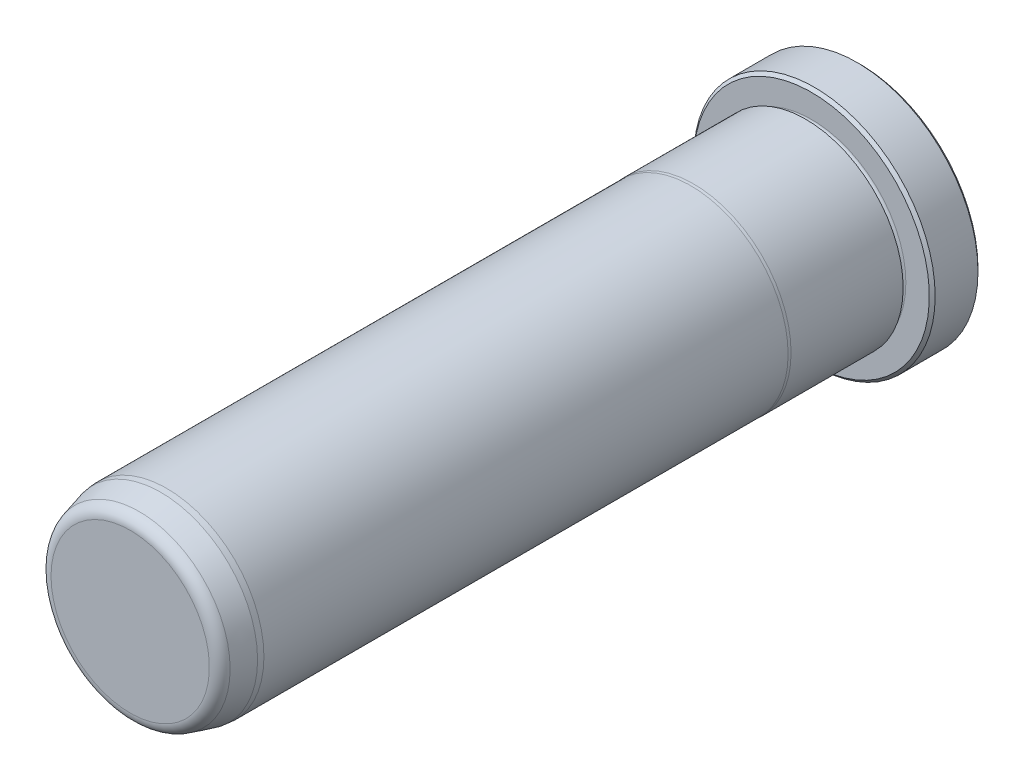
from build123d import *

# Parameters (mm, degrees)
FILLET6_R     = 1.5875
CHAMFER1_SIZE = 0.381


with BuildPart() as part:
    # Sketch1 → Revolve1 (revolve)
    with BuildSketch(Plane(origin=(0, 0, 0), x_dir=(0, 0, -1), z_dir=(1, 0, 0)), mode=Mode.PRIVATE) as revolve1_sk:
        with BuildLine():
            Line((0, 0), (0, 15.748))
            Line((0, 15.748), (-6.35, 15.748))
            Line((-6.35, 15.748), (-6.35, 12.3063))
            ThreePointArc((-6.35, 12.3063), (-6.731, 11.9253), (-7.112, 12.3063))
            Line((-7.112, 12.3063), (-7.112, 12.7127))
            Line((-7.112, 12.7127), (-21.734763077, 12.7127))
            Line((-21.734763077, 12.7127), (-22.098, 12.6873))
            Line((-22.098, 12.6873), (-90.4875, 12.6873))
            Line((-90.4875, 12.6873), (-91.2495, 12.620633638))
            Line((-91.2495, 12.620633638), (-95.25, 11.548702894))
            Line((-95.25, 11.548702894), (-95.25, 0))
            Line((-95.25, 0), (0, 0))
        make_face()
    revolve(revolve1_sk.sketch.rotate(Axis((0, 0, 0), (0, 0, -1)), 90), axis=Axis((0, 0, 0), (0, 0, -1)))

    # Fillet6
    fillet6_edges = [part.edges().sort_by_distance(p)[0] for p in [
        (-11.548702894, 0, 95.25),
    ]]
    fillet(fillet6_edges, radius=FILLET6_R)

    # Chamfer1
    chamfer1_edges = [part.edges().sort_by_distance(p)[0] for p in [
        (-15.748, 0, 6.35),
        (-15.748, 0, 0),
    ]]
    chamfer(chamfer1_edges, length=CHAMFER1_SIZE)


solid = part.part
